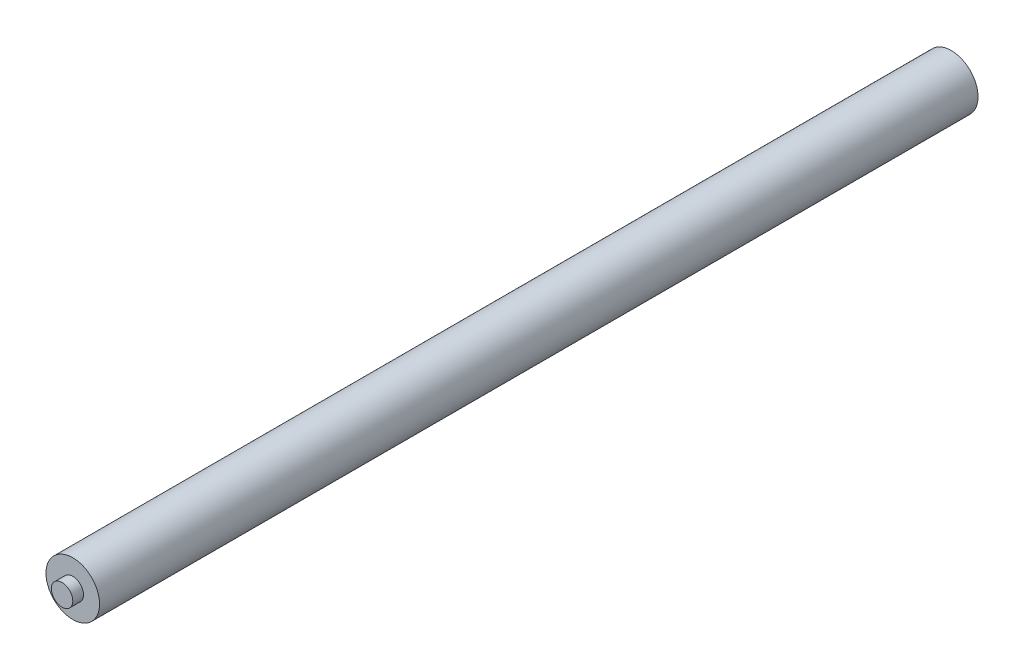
ISO-10303-21;
HEADER;
FILE_DESCRIPTION(('STEP AP214'),'2;1');
FILE_NAME('part.step','',(''),(''),'','','');
FILE_SCHEMA(('AUTOMOTIVE_DESIGN { 1 0 10303 214 1 1 1 1 }'));
ENDSEC;
DATA;
#1=APPLICATION_CONTEXT('core data for automotive mechanical design processes');
#2=APPLICATION_PROTOCOL_DEFINITION('international standard','automotive_design',2000,#1);
#3=PRODUCT_CONTEXT('',#1,'mechanical');
#4=PRODUCT('Part','Part','',(#3));
#5=PRODUCT_RELATED_PRODUCT_CATEGORY('part','',(#4));
#6=PRODUCT_DEFINITION_FORMATION('','',#4);
#7=PRODUCT_DEFINITION_CONTEXT('part definition',#1,'design');
#8=PRODUCT_DEFINITION('design','',#6,#7);
#9=PRODUCT_DEFINITION_SHAPE('','',#8);
#10=(LENGTH_UNIT() NAMED_UNIT(*) SI_UNIT(.MILLI.,.METRE.));
#11=(NAMED_UNIT(*) PLANE_ANGLE_UNIT() SI_UNIT($,.RADIAN.));
#12=(NAMED_UNIT(*) SI_UNIT($,.STERADIAN.) SOLID_ANGLE_UNIT());
#13=UNCERTAINTY_MEASURE_WITH_UNIT(LENGTH_MEASURE(1.E-05),#10,'distance_accuracy_value','');
#14=(GEOMETRIC_REPRESENTATION_CONTEXT(3) GLOBAL_UNCERTAINTY_ASSIGNED_CONTEXT((#13)) GLOBAL_UNIT_ASSIGNED_CONTEXT((#10,
#11,#12)) REPRESENTATION_CONTEXT('',''));
#15=CARTESIAN_POINT('',(0.,0.,0.));
#16=DIRECTION('',(0.,0.,1.));
#17=DIRECTION('',(1.,0.,0.));
#18=AXIS2_PLACEMENT_3D('',#15,#16,#17);
#19=CARTESIAN_POINT('',(0.,0.,410.));
#20=DIRECTION('',(0.,0.,-1.));
#21=DIRECTION('',(-1.,0.,0.));
#22=AXIS2_PLACEMENT_3D('',#19,#20,#21);
#23=CYLINDRICAL_SURFACE('',#22,12.5);
#24=CARTESIAN_POINT('',(0.,0.,410.));
#25=DIRECTION('',(0.,0.,1.));
#26=DIRECTION('',(1.,0.,0.));
#27=AXIS2_PLACEMENT_3D('',#24,#25,#26);
#28=CIRCLE('',#27,12.5);
#29=CARTESIAN_POINT('',(-12.5,0.,410.));
#30=VERTEX_POINT('',#29);
#31=EDGE_CURVE('E45',#30,#30,#28,.T.);
#32=CARTESIAN_POINT('',(0.,0.,0.));
#33=DIRECTION('',(0.,0.,1.));
#34=DIRECTION('',(1.,0.,0.));
#35=AXIS2_PLACEMENT_3D('',#32,#33,#34);
#36=CIRCLE('',#35,12.5);
#37=CARTESIAN_POINT('',(-12.5,0.,0.));
#38=VERTEX_POINT('',#37);
#39=EDGE_CURVE('E40',#38,#38,#36,.T.);
#40=CARTESIAN_POINT('',(-12.5,0.,410.));
#41=CARTESIAN_POINT('',(-12.5,0.,405.729166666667));
#42=CARTESIAN_POINT('',(-12.5,0.,401.458333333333));
#43=CARTESIAN_POINT('',(-12.5,0.,392.916666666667));
#44=CARTESIAN_POINT('',(-12.5,0.,388.645833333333));
#45=CARTESIAN_POINT('',(-12.5,0.,380.104166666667));
#46=CARTESIAN_POINT('',(-12.5,0.,375.833333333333));
#47=CARTESIAN_POINT('',(-12.5,0.,367.291666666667));
#48=CARTESIAN_POINT('',(-12.5,0.,363.020833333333));
#49=CARTESIAN_POINT('',(-12.5,0.,354.479166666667));
#50=CARTESIAN_POINT('',(-12.5,0.,350.208333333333));
#51=CARTESIAN_POINT('',(-12.5,0.,341.666666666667));
#52=CARTESIAN_POINT('',(-12.5,0.,337.395833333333));
#53=CARTESIAN_POINT('',(-12.5,0.,328.854166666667));
#54=CARTESIAN_POINT('',(-12.5,0.,324.583333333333));
#55=CARTESIAN_POINT('',(-12.5,0.,316.041666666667));
#56=CARTESIAN_POINT('',(-12.5,0.,311.770833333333));
#57=CARTESIAN_POINT('',(-12.5,0.,303.229166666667));
#58=CARTESIAN_POINT('',(-12.5,0.,298.958333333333));
#59=CARTESIAN_POINT('',(-12.5,0.,290.416666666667));
#60=CARTESIAN_POINT('',(-12.5,0.,286.145833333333));
#61=CARTESIAN_POINT('',(-12.5,0.,277.604166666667));
#62=CARTESIAN_POINT('',(-12.5,0.,273.333333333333));
#63=CARTESIAN_POINT('',(-12.5,0.,264.791666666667));
#64=CARTESIAN_POINT('',(-12.5,0.,260.520833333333));
#65=CARTESIAN_POINT('',(-12.5,0.,251.979166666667));
#66=CARTESIAN_POINT('',(-12.5,0.,247.708333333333));
#67=CARTESIAN_POINT('',(-12.5,0.,239.166666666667));
#68=CARTESIAN_POINT('',(-12.5,0.,234.895833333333));
#69=CARTESIAN_POINT('',(-12.5,0.,226.354166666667));
#70=CARTESIAN_POINT('',(-12.5,0.,222.083333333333));
#71=CARTESIAN_POINT('',(-12.5,0.,213.541666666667));
#72=CARTESIAN_POINT('',(-12.5,0.,209.270833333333));
#73=CARTESIAN_POINT('',(-12.5,0.,200.729166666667));
#74=CARTESIAN_POINT('',(-12.5,0.,196.458333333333));
#75=CARTESIAN_POINT('',(-12.5,0.,187.916666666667));
#76=CARTESIAN_POINT('',(-12.5,0.,183.645833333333));
#77=CARTESIAN_POINT('',(-12.5,0.,175.104166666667));
#78=CARTESIAN_POINT('',(-12.5,0.,170.833333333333));
#79=CARTESIAN_POINT('',(-12.5,0.,162.291666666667));
#80=CARTESIAN_POINT('',(-12.5,0.,158.020833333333));
#81=CARTESIAN_POINT('',(-12.5,0.,149.479166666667));
#82=CARTESIAN_POINT('',(-12.5,0.,145.208333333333));
#83=CARTESIAN_POINT('',(-12.5,0.,136.666666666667));
#84=CARTESIAN_POINT('',(-12.5,0.,132.395833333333));
#85=CARTESIAN_POINT('',(-12.5,0.,123.854166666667));
#86=CARTESIAN_POINT('',(-12.5,0.,119.583333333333));
#87=CARTESIAN_POINT('',(-12.5,0.,111.041666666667));
#88=CARTESIAN_POINT('',(-12.5,0.,106.770833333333));
#89=CARTESIAN_POINT('',(-12.5,0.,98.2291666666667));
#90=CARTESIAN_POINT('',(-12.5,0.,93.9583333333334));
#91=CARTESIAN_POINT('',(-12.5,0.,85.4166666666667));
#92=CARTESIAN_POINT('',(-12.5,0.,81.1458333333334));
#93=CARTESIAN_POINT('',(-12.5,0.,72.6041666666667));
#94=CARTESIAN_POINT('',(-12.5,0.,68.3333333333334));
#95=CARTESIAN_POINT('',(-12.5,0.,59.7916666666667));
#96=CARTESIAN_POINT('',(-12.5,0.,55.5208333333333));
#97=CARTESIAN_POINT('',(-12.5,0.,46.9791666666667));
#98=CARTESIAN_POINT('',(-12.5,0.,42.7083333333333));
#99=CARTESIAN_POINT('',(-12.5,0.,34.1666666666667));
#100=CARTESIAN_POINT('',(-12.5,0.,29.8958333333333));
#101=CARTESIAN_POINT('',(-12.5,0.,21.3541666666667));
#102=CARTESIAN_POINT('',(-12.5,0.,17.0833333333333));
#103=CARTESIAN_POINT('',(-12.5,0.,8.54166666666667));
#104=CARTESIAN_POINT('',(-12.5,0.,4.27083333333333));
#105=CARTESIAN_POINT('',(-12.5,0.,0.));
#106=B_SPLINE_CURVE_WITH_KNOTS('',3,(#40,#41,#42,#43,#44,#45,#46,#47,#48,#49,#50,#51,#52,#53,
#54,#55,#56,#57,#58,#59,#60,#61,#62,#63,#64,#65,#66,#67,#68,#69,#70,#71,#72,#73,#74,#75,#76,#77,
#78,#79,#80,#81,#82,#83,#84,#85,#86,#87,#88,#89,#90,#91,#92,#93,#94,#95,#96,#97,#98,#99,#100,
#101,#102,#103,#104,#105),.UNSPECIFIED.,.F.,.F.,(4,2,2,2,2,2,2,2,2,2,2,2,2,2,2,2,2,2,2,2,2,2,2,
2,2,2,2,2,2,2,2,2,4),(0.,12.8125,25.625,38.4375,51.25,64.0625,76.875,89.6875,102.5,115.3125,
128.125,140.9375,153.75,166.5625,179.375,192.1875,205.,217.8125,230.625,243.4375,256.25,
269.0625,281.875,294.6875,307.5,320.3125,333.125,345.9375,358.75,371.5625,384.375,397.1875,
410.),.UNSPECIFIED.);
#107=EDGE_CURVE('BSEAM37',#30,#38,#106,.T.);
#108=ORIENTED_EDGE('',*,*,#31,.F.);
#109=ORIENTED_EDGE('',*,*,#39,.T.);
#110=ORIENTED_EDGE('',*,*,#107,.T.);
#111=ORIENTED_EDGE('',*,*,#107,.F.);
#112=EDGE_LOOP('',(#108,#110,#109,#111));
#113=FACE_BOUND('',#112,.T.);
#114=ADVANCED_FACE('F37',(#113),#23,.T.);
#115=CARTESIAN_POINT('',(0.,0.,410.));
#116=DIRECTION('',(0.,0.,1.));
#117=DIRECTION('',(1.,0.,0.));
#118=AXIS2_PLACEMENT_3D('',#115,#116,#117);
#119=PLANE('',#118);
#120=CARTESIAN_POINT('',(0.,0.,410.));
#121=DIRECTION('',(0.,0.,1.));
#122=DIRECTION('',(1.,0.,0.));
#123=AXIS2_PLACEMENT_3D('',#120,#121,#122);
#124=CIRCLE('',#123,5.);
#125=CARTESIAN_POINT('',(5.,0.,410.));
#126=VERTEX_POINT('',#125);
#127=EDGE_CURVE('E10',#126,#126,#124,.T.);
#128=ORIENTED_EDGE('',*,*,#127,.F.);
#129=EDGE_LOOP('',(#128));
#130=FACE_BOUND('',#129,.T.);
#131=ORIENTED_EDGE('',*,*,#31,.T.);
#132=EDGE_LOOP('',(#131));
#133=FACE_BOUND('',#132,.T.);
#134=ADVANCED_FACE('F65',(#130,#133),#119,.T.);
#135=CARTESIAN_POINT('',(0.,0.,0.));
#136=DIRECTION('',(0.,0.,1.));
#137=DIRECTION('',(1.,0.,0.));
#138=AXIS2_PLACEMENT_3D('',#135,#136,#137);
#139=PLANE('',#138);
#140=ORIENTED_EDGE('',*,*,#39,.F.);
#141=EDGE_LOOP('',(#140));
#142=FACE_BOUND('',#141,.T.);
#143=ADVANCED_FACE('F62',(#142),#139,.F.);
#144=CARTESIAN_POINT('',(0.,0.,415.));
#145=DIRECTION('',(0.,0.,-1.));
#146=DIRECTION('',(-1.,0.,0.));
#147=AXIS2_PLACEMENT_3D('',#144,#145,#146);
#148=CYLINDRICAL_SURFACE('',#147,5.);
#149=CARTESIAN_POINT('',(0.,0.,415.));
#150=DIRECTION('',(0.,0.,1.));
#151=DIRECTION('',(1.,0.,0.));
#152=AXIS2_PLACEMENT_3D('',#149,#150,#151);
#153=CIRCLE('',#152,5.);
#154=CARTESIAN_POINT('',(5.,0.,415.));
#155=VERTEX_POINT('',#154);
#156=EDGE_CURVE('E52',#155,#155,#153,.T.);
#157=ORIENTED_EDGE('',*,*,#156,.F.);
#158=EDGE_LOOP('',(#157));
#159=FACE_BOUND('',#158,.T.);
#160=ORIENTED_EDGE('',*,*,#127,.T.);
#161=EDGE_LOOP('',(#160));
#162=FACE_BOUND('',#161,.T.);
#163=ADVANCED_FACE('F64',(#159,#162),#148,.T.);
#164=CARTESIAN_POINT('',(0.,0.,415.));
#165=DIRECTION('',(0.,0.,1.));
#166=DIRECTION('',(1.,0.,0.));
#167=AXIS2_PLACEMENT_3D('',#164,#165,#166);
#168=PLANE('',#167);
#169=ORIENTED_EDGE('',*,*,#156,.T.);
#170=EDGE_LOOP('',(#169));
#171=FACE_BOUND('',#170,.T.);
#172=ADVANCED_FACE('F70',(#171),#168,.T.);
#173=CLOSED_SHELL('',(#114,#134,#143,#163,#172));
#174=MANIFOLD_SOLID_BREP('B2',#173);
#175=ADVANCED_BREP_SHAPE_REPRESENTATION('',(#18,#174),#14);
#176=SHAPE_DEFINITION_REPRESENTATION(#9,#175);
ENDSEC;
END-ISO-10303-21;
